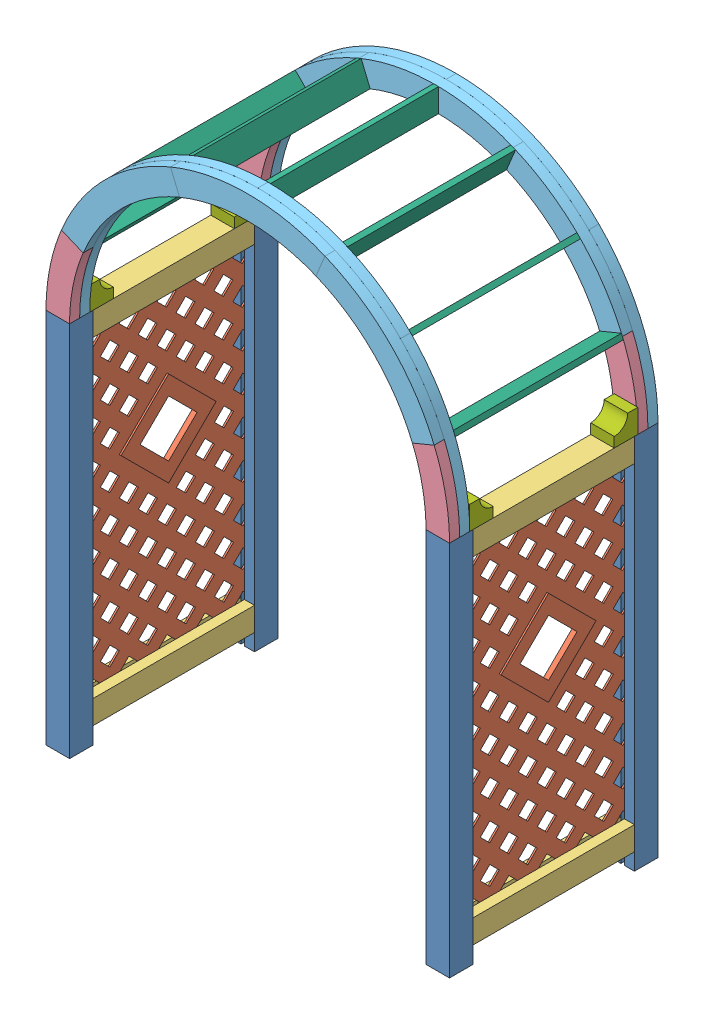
SolidWorks assembly arbor-assembly.SLDASM, configuration Default (file format 13000). Lengths in mm.
Overall size (1632.62 2239.83 787.4).
41 component instances, 7 part files, 47 mates.
Components (placement in the parent):
- post-1: post.SLDPRT [Default] at (-913.5814 255.0061 1979.3698) size (88.9 1422.4 88.9)
- post-2: post.SLDPRT [Default] at (-913.5814 255.0061 1280.8698) x (-1 0 0) z (0 0 -1) size (88.9 1422.4 88.9)
- post-3: post.SLDPRT [Default] at (521.5186 255.0061 1280.8698) x (-1 0 0) z (0 0 -1) size (88.9 1422.4 88.9)
- post-4: post.SLDPRT [Default] at (521.5186 255.0061 1979.3698) size (88.9 1422.4 88.9)
- lattice-1: lattice.SLDPRT [Default] at (-913.5814 997.9561 1636.4698) x (0 0 -1) z (1 0 0) size (660.4 1219.2 19.05)
- lattice-2: lattice.SLDPRT [Default] at (521.5186 997.9561 1636.4698) x (0 0 -1) z (1 0 0) size (660.4 1219.2 19.05)
- lateral-4x4-28: lateral-4x4.SLDPRT [Default] at (521.5186 1632.9561 1325.3198) x (-1 0 0) z (0 0 1) size (88.9 88.9 609.6)
- lateral-4x4-29: lateral-4x4.SLDPRT [Default] at (-913.5814 1632.9561 1934.9198) x (1 0 0) z (0 0 -1) size (88.9 88.9 609.6)
- arch-assembly-1: arch-assembly.SLDASM [Default] at (279.9642 1772.5642 1656.8918) x (0.001699 -0.999999 0) z (0 0 1) size (848.75 1631.18 76.2)
  - arch-22-5-degrees-1: arch-22-5-degrees.SLDPRT [Default] at (-162.1782 146.1434 328.828) size (291.7 139.7 38.1)
  - arch-45-degrees-1: arch-45-degrees.SLDPRT [Default] at (-380.7951 0.6049 290.728) x (0.92388 0.382683 0) z (0 0 1) size (583.21 140.58 38.1)
  - arch-45-degrees-2: arch-45-degrees.SLDPRT [Default] at (-578.7498 -475.0131 290.728) x (0.382683 0.92388 0) z (0 0 1) size (583.21 140.58 38.1)
  - arch-45-degrees-3: arch-45-degrees.SLDPRT [Default] at (-382.4122 -951.3009 290.728) x (-0.382683 0.92388 0) z (0 0 1) size (583.21 140.58 38.1)
  - arch-22-5-degrees-2: arch-22-5-degrees.SLDPRT [Default] at (-164.291 -1097.5814 366.928) x (0.999994 -0.003398 0) z (0 0 -1) size (291.7 139.7 38.1)
  - arch-45-degrees-4: arch-45-degrees.SLDPRT [Default] at (-527.0756 -217.5163 328.828) x (0.707107 0.707107 0) z (0 0 1) size (583.21 140.58 38.1)
  - arch-45-degrees-5: arch-45-degrees.SLDPRT [Default] at (-527.9507 -732.684 328.828) x (0 1 0) z (0 0 1) size (583.21 140.58 38.1)
  - arch-45-degrees-6: arch-45-degrees.SLDPRT [Default] at (93.2058 -1149.2556 290.728) x (-0.92388 0.382683 0) z (0 0 1) size (583.21 140.58 38.1)
  - arch-45-degrees-7: arch-45-degrees.SLDPRT [Default] at (-164.291 -1097.5814 328.828) x (-0.707107 0.707107 0) z (0 0 1) size (583.21 140.58 38.1)
- arch-assembly-2: arch-assembly.SLDASM [Default] at (279.9642 1772.5642 945.6918) x (0.001699 -0.999999 0) z (0 0 1) size (848.75 1631.18 76.2)
  - arch-22-5-degrees-1: arch-22-5-degrees.SLDPRT [Default] at (-162.1782 146.1434 328.828) size (291.7 139.7 38.1)
  - arch-45-degrees-1: arch-45-degrees.SLDPRT [Default] at (-380.7951 0.6049 290.728) x (0.92388 0.382683 0) z (0 0 1) size (583.21 140.58 38.1)
  - arch-45-degrees-2: arch-45-degrees.SLDPRT [Default] at (-578.7498 -475.0131 290.728) x (0.382683 0.92388 0) z (0 0 1) size (583.21 140.58 38.1)
  - arch-45-degrees-3: arch-45-degrees.SLDPRT [Default] at (-382.4122 -951.3009 290.728) x (-0.382683 0.92388 0) z (0 0 1) size (583.21 140.58 38.1)
  - arch-22-5-degrees-2: arch-22-5-degrees.SLDPRT [Default] at (-164.291 -1097.5814 366.928) x (0.999994 -0.003398 0) z (0 0 -1) size (291.7 139.7 38.1)
  - arch-45-degrees-4: arch-45-degrees.SLDPRT [Default] at (-527.0756 -217.5163 328.828) x (0.707107 0.707107 0) z (0 0 1) size (583.21 140.58 38.1)
  - arch-45-degrees-5: arch-45-degrees.SLDPRT [Default] at (-527.9507 -732.684 328.828) x (0 1 0) z (0 0 1) size (583.21 140.58 38.1)
  - arch-45-degrees-6: arch-45-degrees.SLDPRT [Default] at (93.2058 -1149.2556 290.728) x (-0.92388 0.382683 0) z (0 0 1) size (583.21 140.58 38.1)
  - arch-45-degrees-7: arch-45-degrees.SLDPRT [Default] at (-164.291 -1097.5814 328.828) x (-0.707107 0.707107 0) z (0 0 1) size (583.21 140.58 38.1)
- lateral-1x4-1: lateral-1x4.SLDPRT [Default] at (-196.0314 2394.9561 1312.6198) size (19.05 88.9 635)
- lateral-1x4-2: lateral-1x4.SLDPRT [Default] at (78.5631 2340.3359 1312.6198) x (0.92388 -0.382683 0) z (0 0 1) size (19.05 88.9 635)
- lateral-1x4-3: lateral-1x4.SLDPRT [Default] at (311.3531 2184.7906 1312.6198) x (0.707107 -0.707107 0) z (0 0 1) size (19.05 88.9 635)
- lateral-1x4-4: lateral-1x4.SLDPRT [Default] at (466.8984 1952.0006 1312.6198) x (0.382683 -0.92388 0) z (0 0 1) size (19.05 88.9 635)
- lateral-1x4-5: lateral-1x4.SLDPRT [Default] at (-470.6259 2340.3359 1312.6198) x (0.92388 0.382683 0) z (0 0 1) size (19.05 88.9 635)
- lateral-1x4-6: lateral-1x4.SLDPRT [Default] at (-703.4158 2184.7906 1312.6198) x (0.707107 0.707107 0) z (0 0 1) size (19.05 88.9 635)
- lateral-1x4-7: lateral-1x4.SLDPRT [Default] at (-858.9611 1952.0006 1312.6198) x (0.382683 0.92388 0) z (0 0 1) size (19.05 88.9 635)
- lateral-4x4-30: lateral-4x4.SLDPRT [Default] at (-913.5814 362.9561 1325.3198) size (88.9 88.9 609.6)
- lateral-4x4-31: lateral-4x4.SLDPRT [Default] at (521.5186 362.9561 1325.3198) size (88.9 88.9 609.6)
- block-1: block.SLDPRT [Default] at (-869.1314 1721.8561 1903.1698) x (0 0 1) z (-1 0 0) size (88.9 88.9 88.9)
- block-2: block.SLDPRT [Default] at (477.0686 1721.8561 1357.0698) x (0 0 -1) z (1 0 0) size (88.9 88.9 88.9)
- block-3: block.SLDPRT [Default] at (-958.0314 1721.8561 1357.0698) x (0 0 -1) z (1 0 0) size (88.9 88.9 88.9)
- block-4: block.SLDPRT [Default] at (565.9686 1721.8561 1903.1698) x (0 0 1) z (-1 0 0) size (88.9 88.9 88.9)
Mates (geometry in assembly coordinates):
- Coincident83: coincident aligned: plane of post-3 through (565.9686 1677.4061 1280.8698) normal (1 0 0); plane of post-4 through (565.9686 1677.4061 1979.3698) normal (1 0 0)
- Coincident85: coincident aligned: plane of post-3 through (521.5186 255.0061 1280.8698) normal (0 -1 0); plane of post-4 through (521.5186 255.0061 1979.3698) normal (0 -1 0)
- Coincident88: coincident aligned: plane of post-01-1 through (-913.5814 255.0061 1979.3698) normal (0 -1 0); plane of post-01-2 through (-913.5814 255.0061 1280.8698) normal (0 -1 0)
- Coincident89: coincident aligned: plane of post-01-1 through (-869.1314 1677.4061 1979.3698) normal (1 0 0); plane of post-01-2 through (-869.1314 1677.4061 1280.8698) normal (1 0 0)
- Coincident105: coincident aligned: plane of post-01-1 through (-913.5814 255.0061 1979.3698) normal (0 -1 0); plane of post-4 through (521.5186 255.0061 1979.3698) normal (0 -1 0)
- Coincident106: coincident anti-aligned: plane of post-4 through (521.5186 1677.4061 1934.9198) normal (0 0 -1); plane of lateral-4x4-28 through (521.5186 1632.9561 1934.9198) normal (0 0 1)
- Coincident107: coincident aligned: plane of post-4 through (477.0686 1677.4061 1979.3698) normal (-1 0 0); plane of lateral-4x4-28 through (477.0686 1632.9561 1934.9198) normal (-1 0 0)
- Coincident108: coincident aligned: plane of post-4 through (521.5186 1677.4061 1979.3698) normal (0 1 0); plane of lateral-4x4-28 through (521.5186 1677.4061 1934.9198) normal (0 1 0)
- Coincident109: coincident anti-aligned: plane of post-3 through (521.5186 1677.4061 1325.3198) normal (0 0 1); plane of lateral-4x4-28 through (521.5186 1632.9561 1325.3198) normal (0 0 -1)
- Coincident110: coincident anti-aligned: plane of lattice-2 through (527.8686 1607.5561 1636.4698) normal (0 1 0); plane of lateral-4x4-28 through (521.5186 1607.5561 1934.9198) normal (0 -1 0)
- Coincident111: coincident anti-aligned: plane of post-3 through (521.5186 1677.4061 1306.2698) normal (0 0 1); plane of lattice-2 through (527.8686 997.9561 1306.2698) normal (0 0 -1)
- Coincident112: coincident anti-aligned: plane of post-3 through (527.8686 1677.4061 1280.8698) normal (-1 0 0); plane of lattice-2 through (527.8686 997.9561 1636.4698) normal (1 0 0)
- Coincident113: coincident anti-aligned: plane of post-01-2 through (-913.5814 1677.4061 1325.3198) normal (0 0 1); plane of lateral-4x4-29 through (-913.5814 1632.9561 1325.3198) normal (0 0 -1)
- Coincident114: coincident anti-aligned: plane of post-01-1 through (-913.5814 1677.4061 1934.9198) normal (0 0 -1); plane of lateral-4x4-29 through (-913.5814 1632.9561 1934.9198) normal (0 0 1)
- Coincident115: coincident aligned: plane of post-01-2 through (-913.5814 1677.4061 1280.8698) normal (0 1 0); plane of lateral-4x4-29 through (-913.5814 1677.4061 1325.3198) normal (0 1 0)
- Coincident116: coincident aligned: plane of post-01-2 through (-869.1314 1677.4061 1280.8698) normal (1 0 0); plane of lateral-4x4-29 through (-869.1314 1632.9561 1325.3198) normal (1 0 0)
- Coincident117: coincident anti-aligned: plane of lattice-01-1 through (-907.2314 1607.5561 1636.4698) normal (0 1 0); plane of lateral-4x4-29 through (-913.5814 1607.5561 1325.3198) normal (0 -1 0)
- Coincident118: coincident anti-aligned: plane of post-01-2 through (-913.5814 1677.4061 1306.2698) normal (0 0 1); plane of lattice-01-1 through (-907.2314 997.9561 1306.2698) normal (0 0 -1)
- Coincident119: coincident anti-aligned: plane of post-01-2 through (-907.2314 1677.4061 1280.8698) normal (-1 0 0); plane of lattice-01-1 through (-907.2314 997.9561 1636.4698) normal (1 0 0)
- Coincident120: coincident anti-aligned: plane of post-4 through (521.5186 1677.4061 1979.3698) normal (0 1 0); plane of arch-assembly-1/arch-30-degrees-1 through (425.8319 1677.4061 2023.8198) normal (0 -1 0)
- Coincident121: coincident aligned: plane of post-4 through (521.5186 1677.4061 2023.8198) normal (0 0 1); plane of arch-assembly-1/arch-30-degrees-1 through (425.8319 1934.9904 2023.8198) normal (0 0 1)
- Coincident122: coincident: point of post-4; point of arch-assembly-1/arch-30-degrees-1
- Coincident123: coincident: point of post-01-1; point of arch-assembly-1/arch-30-degrees-2
- Coincident124: coincident anti-aligned: plane of post-3 through (521.5186 1677.4061 1280.8698) normal (0 1 0); plane of arch-assembly-2/arch-45-degrees-1 through (279.9222 1677.4061 1274.5198) normal (0 -1 0)
- Coincident126: coincident: point of post-3; point of arch-assembly-2/arch-45-degrees-1
- Coincident127: coincident aligned: plane of post-3 through (521.5186 1677.4061 1236.4198) normal (0 0 -1); plane of arch-assembly-2/arch-45-degrees-1 through (279.9222 2153.3597 1236.4198) normal (0 0 -1)
- Coincident128: coincident anti-aligned: plane of arch-assembly-1/arch-45-degrees-2 through (-196.0314 2350.5061 1947.6198) normal (0 0 -1); plane of lateral-1x4-1 through (-196.0314 2394.9561 1947.6198) normal (0 0 1)
- Coincident129: coincident: circle of arch-assembly-1/arch-60-degrees-2; moEndPointRef_w of lateral-1x4-1
- Width5: width anti-aligned: plane of lateral-4x4-28 through (565.9686 1632.9561 1934.9198) normal (1 0 0); plane of lateral-1x4-1 through (-958.0314 1632.9561 1325.3198) normal (-1 0 0); plane of lateral-4x4-29 through (-205.5564 2394.9561 1947.6198) normal (-1 0 0); plane of lateral-1x4-1 through (-186.5064 2394.9561 1947.6198) normal (1 0 0)
- Coincident130: coincident: plane of post-4 through (521.5186 1677.4061 1934.9198) normal (0 0 -1); plane of lateral-4x4-31 through (521.5186 362.9561 1934.9198) normal (0 0 1)
- Coincident131: coincident: plane of lattice-2 through (527.8686 388.3561 1636.4698) normal (0 -1 0); plane of lateral-4x4-31 through (521.5186 388.3561 1934.9198) normal (0 1 0)
- Coincident132: coincident aligned: plane of post-4 through (565.9686 1677.4061 1979.3698) normal (1 0 0); plane of lateral-4x4-31 through (565.9686 362.9561 1934.9198) normal (1 0 0)
- Coincident133: coincident: plane of post-2 through (-913.5814 1677.4061 1325.3198) normal (0 0 1); plane of lateral-4x4-30 through (-913.5814 362.9561 1325.3198) normal (0 0 -1)
- Coincident134: coincident: plane of post-2 through (-869.1314 1677.4061 1280.8698) normal (1 0 0); plane of lateral-4x4-30 through (-869.1314 362.9561 1934.9198) normal (1 0 0)
- Coincident135: coincident anti-aligned: plane of lattice-1 through (-907.2314 388.3561 1636.4698) normal (0 -1 0); plane of lateral-4x4-30 through (-913.5814 388.3561 1934.9198) normal (0 1 0)
- Coincident136: coincident: plane of lateral-4x4-28 through (521.5186 1677.4061 1934.9198) normal (0 1 0); plane of block-4 through (477.0686 1677.4061 1903.1698) normal (0 -1 0)
- Coincident137: coincident: plane of lateral-4x4-28 through (521.5186 1677.4061 1934.9198) normal (0 1 0); plane of block-2 through (565.9686 1677.4061 1357.0698) normal (0 -1 0)
- Coincident138: coincident: plane of arch-assembly-2/arch-22-5-degrees-1 through (425.8319 1934.9904 1312.6198) normal (0 0 1); plane of block-2 through (565.9686 1721.8561 1312.6198) normal (0 0 -1)
- Coincident139: coincident aligned: plane of lateral-4x4-28 through (565.9686 1632.9561 1934.9198) normal (1 0 0); plane of block-2 through (565.9686 1721.8561 1357.0698) normal (1 0 0)
- Coincident140: coincident: plane of arch-assembly-1/arch-45-degrees-1 through (279.9222 2153.3597 1947.6198) normal (0 0 -1); plane of block-4 through (477.0686 1721.8561 1947.6198) normal (0 0 1)
- Coincident141: coincident aligned: plane of lateral-4x4-28 through (565.9686 1632.9561 1934.9198) normal (1 0 0); plane of block-4 through (565.9686 1721.8561 1903.1698) normal (1 0 0)
- Coincident142: coincident: plane of lateral-4x4-29 through (-913.5814 1677.4061 1325.3198) normal (0 1 0); plane of block-1 through (-958.0314 1677.4061 1903.1698) normal (0 -1 0)
- Coincident143: coincident: plane of lateral-4x4-29 through (-913.5814 1677.4061 1325.3198) normal (0 1 0); plane of block-3 through (-869.1314 1677.4061 1357.0698) normal (0 -1 0)
- Coincident144: coincident: plane of arch-assembly-2/arch-22-5-degrees-2 through (-817.8947 1934.9904 1312.6198) normal (0 0 1); plane of block-3 through (-869.1314 1721.8561 1312.6198) normal (0 0 -1)
- Coincident145: coincident: plane of arch-assembly-1/arch-45-degrees-6 through (-869.1314 1677.4061 1947.6198) normal (0 0 -1); plane of block-1 through (-958.0314 1721.8561 1947.6198) normal (0 0 1)
- Coincident146: coincident aligned: plane of lateral-4x4-29 through (-869.1314 1632.9561 1325.3198) normal (1 0 0); plane of block-3 through (-869.1314 1721.8561 1357.0698) normal (1 0 0)
- Coincident147: coincident aligned: plane of lateral-4x4-29 through (-869.1314 1632.9561 1325.3198) normal (1 0 0); plane of block-1 through (-869.1314 1721.8561 1903.1698) normal (1 0 0)
